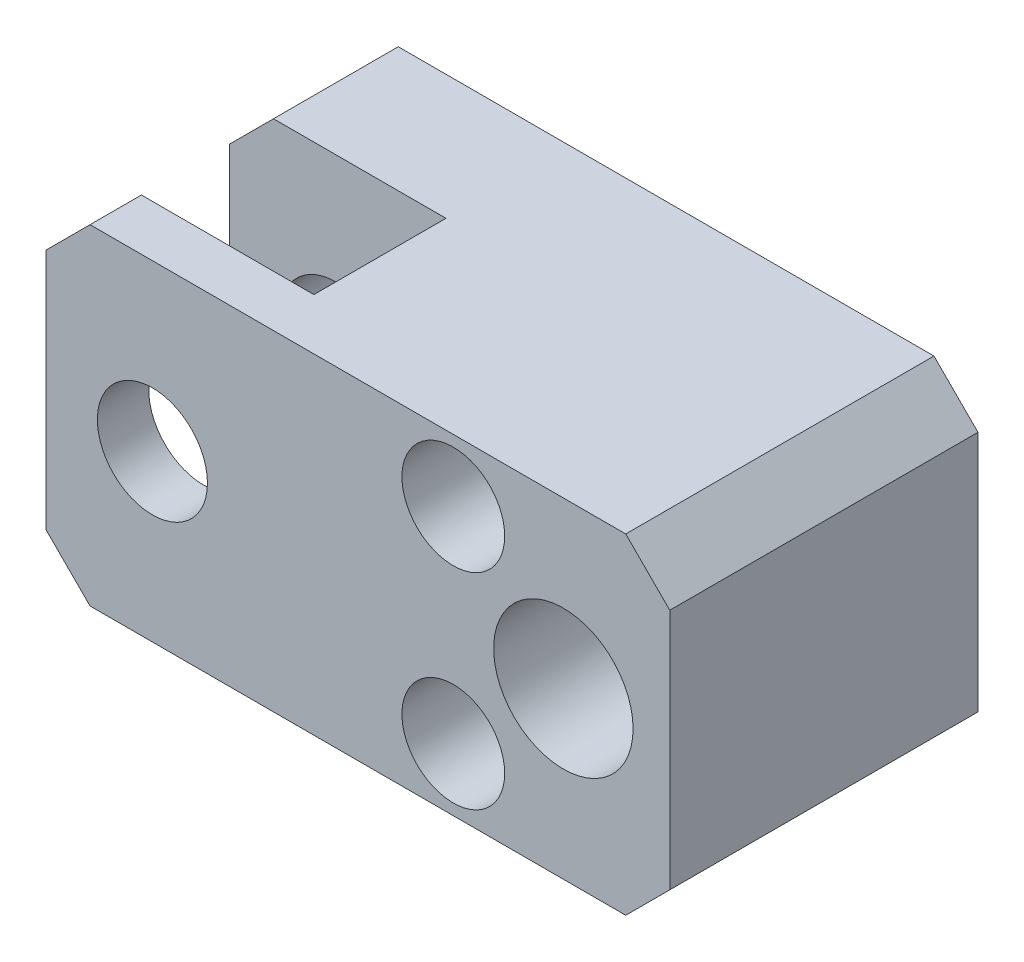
ISO-10303-21;
HEADER;
FILE_DESCRIPTION(('STEP AP214'),'2;1');
FILE_NAME('part.step','',(''),(''),'','','');
FILE_SCHEMA(('AUTOMOTIVE_DESIGN { 1 0 10303 214 1 1 1 1 }'));
ENDSEC;
DATA;
#1=APPLICATION_CONTEXT('core data for automotive mechanical design processes');
#2=APPLICATION_PROTOCOL_DEFINITION('international standard','automotive_design',2000,#1);
#3=PRODUCT_CONTEXT('',#1,'mechanical');
#4=PRODUCT('Part','Part','',(#3));
#5=PRODUCT_RELATED_PRODUCT_CATEGORY('part','',(#4));
#6=PRODUCT_DEFINITION_FORMATION('','',#4);
#7=PRODUCT_DEFINITION_CONTEXT('part definition',#1,'design');
#8=PRODUCT_DEFINITION('design','',#6,#7);
#9=PRODUCT_DEFINITION_SHAPE('','',#8);
#10=(LENGTH_UNIT() NAMED_UNIT(*) SI_UNIT(.MILLI.,.METRE.));
#11=(NAMED_UNIT(*) PLANE_ANGLE_UNIT() SI_UNIT($,.RADIAN.));
#12=(NAMED_UNIT(*) SI_UNIT($,.STERADIAN.) SOLID_ANGLE_UNIT());
#13=UNCERTAINTY_MEASURE_WITH_UNIT(LENGTH_MEASURE(1.E-05),#10,'distance_accuracy_value','');
#14=(GEOMETRIC_REPRESENTATION_CONTEXT(3) GLOBAL_UNCERTAINTY_ASSIGNED_CONTEXT((#13)) GLOBAL_UNIT_ASSIGNED_CONTEXT((#10,
#11,#12)) REPRESENTATION_CONTEXT('',''));
#15=CARTESIAN_POINT('',(0.,0.,0.));
#16=DIRECTION('',(0.,0.,1.));
#17=DIRECTION('',(1.,0.,0.));
#18=AXIS2_PLACEMENT_3D('',#15,#16,#17);
#19=CARTESIAN_POINT('',(-41.,14.,17.));
#20=DIRECTION('',(0.,0.,1.));
#21=DIRECTION('',(1.,0.,0.));
#22=AXIS2_PLACEMENT_3D('',#19,#20,#21);
#23=CYLINDRICAL_SURFACE('',#22,4.5);
#24=CARTESIAN_POINT('',(-41.,14.,0.));
#25=DIRECTION('',(0.,0.,1.));
#26=DIRECTION('',(1.,0.,0.));
#27=AXIS2_PLACEMENT_3D('',#24,#25,#26);
#28=CIRCLE('',#27,4.5);
#29=CARTESIAN_POINT('',(-36.5,14.,0.));
#30=VERTEX_POINT('',#29);
#31=EDGE_CURVE('E350',#30,#30,#28,.T.);
#32=ORIENTED_EDGE('',*,*,#31,.F.);
#33=EDGE_LOOP('',(#32));
#34=FACE_BOUND('',#33,.T.);
#35=CARTESIAN_POINT('',(-41.,14.,9.5));
#36=DIRECTION('',(0.,0.,1.));
#37=DIRECTION('',(1.,0.,0.));
#38=AXIS2_PLACEMENT_3D('',#35,#36,#37);
#39=CIRCLE('',#38,4.5);
#40=CARTESIAN_POINT('',(-36.5,14.,9.5));
#41=VERTEX_POINT('',#40);
#42=EDGE_CURVE('E186',#41,#41,#39,.F.);
#43=ORIENTED_EDGE('',*,*,#42,.F.);
#44=EDGE_LOOP('',(#43));
#45=FACE_BOUND('',#44,.T.);
#46=ADVANCED_FACE('F14',(#34,#45),#23,.F.);
#47=CARTESIAN_POINT('',(-26.,36.5,35.));
#48=DIRECTION('',(1.,0.,0.));
#49=DIRECTION('',(0.,1.,0.));
#50=AXIS2_PLACEMENT_3D('',#47,#48,#49);
#51=PLANE('',#50);
#52=DIRECTION('',(0.,0.,1.));
#53=VECTOR('',#52,1.);
#54=CARTESIAN_POINT('',(-26.,-8.5,35.));
#55=LINE('',#54,#53);
#56=CARTESIAN_POINT('',(-26.,-8.5,17.));
#57=VERTEX_POINT('',#56);
#58=CARTESIAN_POINT('',(-26.,-8.5,35.));
#59=VERTEX_POINT('',#58);
#60=EDGE_CURVE('E127',#57,#59,#55,.T.);
#61=ORIENTED_EDGE('',*,*,#60,.T.);
#62=DIRECTION('',(0.,-1.,0.));
#63=VECTOR('',#62,1.);
#64=CARTESIAN_POINT('',(-26.,36.5,35.));
#65=LINE('',#64,#63);
#66=CARTESIAN_POINT('',(-26.,36.5,35.));
#67=VERTEX_POINT('',#66);
#68=EDGE_CURVE('E136',#67,#59,#65,.T.);
#69=ORIENTED_EDGE('',*,*,#68,.F.);
#70=DIRECTION('',(0.,0.,1.));
#71=VECTOR('',#70,1.);
#72=CARTESIAN_POINT('',(-26.,36.5,35.));
#73=LINE('',#72,#71);
#74=CARTESIAN_POINT('',(-26.,36.5,17.));
#75=VERTEX_POINT('',#74);
#76=EDGE_CURVE('E135',#75,#67,#73,.T.);
#77=ORIENTED_EDGE('',*,*,#76,.F.);
#78=DIRECTION('',(0.,-1.,0.));
#79=VECTOR('',#78,1.);
#80=CARTESIAN_POINT('',(-26.,36.5,17.));
#81=LINE('',#80,#79);
#82=EDGE_CURVE('E119',#75,#57,#81,.T.);
#83=ORIENTED_EDGE('',*,*,#82,.T.);
#84=EDGE_LOOP('',(#61,#69,#77,#83));
#85=FACE_BOUND('',#84,.T.);
#86=ADVANCED_FACE('F132',(#85),#51,.F.);
#87=CARTESIAN_POINT('',(-55.5,36.5,17.));
#88=DIRECTION('',(0.,0.,-1.));
#89=DIRECTION('',(0.,1.,0.));
#90=AXIS2_PLACEMENT_3D('',#87,#88,#89);
#91=PLANE('',#90);
#92=CARTESIAN_POINT('',(-41.,14.,17.));
#93=DIRECTION('',(0.,0.,-1.));
#94=DIRECTION('',(0.,1.,0.));
#95=AXIS2_PLACEMENT_3D('',#92,#93,#94);
#96=CIRCLE('',#95,7.5);
#97=CARTESIAN_POINT('',(-41.,21.5,17.));
#98=VERTEX_POINT('',#97);
#99=EDGE_CURVE('E193',#98,#98,#96,.T.);
#100=ORIENTED_EDGE('',*,*,#99,.T.);
#101=EDGE_LOOP('',(#100));
#102=FACE_BOUND('',#101,.T.);
#103=DIRECTION('',(0.,-1.,0.));
#104=VECTOR('',#103,1.);
#105=CARTESIAN_POINT('',(-55.5,36.5,17.));
#106=LINE('',#105,#104);
#107=CARTESIAN_POINT('',(-55.5,30.5,17.));
#108=VERTEX_POINT('',#107);
#109=CARTESIAN_POINT('',(-55.5,-2.5,17.));
#110=VERTEX_POINT('',#109);
#111=EDGE_CURVE('E137',#108,#110,#106,.T.);
#112=ORIENTED_EDGE('',*,*,#111,.T.);
#113=DIRECTION('',(0.707106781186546,-0.707106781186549,0.));
#114=VECTOR('',#113,1.);
#115=CARTESIAN_POINT('',(-49.5,-8.5,17.));
#116=LINE('',#115,#114);
#117=CARTESIAN_POINT('',(-49.5,-8.5,17.));
#118=VERTEX_POINT('',#117);
#119=EDGE_CURVE('E122',#110,#118,#116,.T.);
#120=ORIENTED_EDGE('',*,*,#119,.T.);
#121=DIRECTION('',(1.,0.,0.));
#122=VECTOR('',#121,1.);
#123=CARTESIAN_POINT('',(-55.5,-8.5,17.));
#124=LINE('',#123,#122);
#125=EDGE_CURVE('E114',#118,#57,#124,.T.);
#126=ORIENTED_EDGE('',*,*,#125,.T.);
#127=ORIENTED_EDGE('',*,*,#82,.F.);
#128=DIRECTION('',(1.,0.,0.));
#129=VECTOR('',#128,1.);
#130=CARTESIAN_POINT('',(-55.5,36.5,17.));
#131=LINE('',#130,#129);
#132=CARTESIAN_POINT('',(-49.5,36.5,17.));
#133=VERTEX_POINT('',#132);
#134=EDGE_CURVE('E145',#133,#75,#131,.T.);
#135=ORIENTED_EDGE('',*,*,#134,.F.);
#136=DIRECTION('',(-0.707106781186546,-0.707106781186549,0.));
#137=VECTOR('',#136,1.);
#138=CARTESIAN_POINT('',(-49.5,36.5,17.));
#139=LINE('',#138,#137);
#140=EDGE_CURVE('E233',#133,#108,#139,.T.);
#141=ORIENTED_EDGE('',*,*,#140,.T.);
#142=EDGE_LOOP('',(#112,#120,#126,#127,#135,#141));
#143=FACE_BOUND('',#142,.T.);
#144=ADVANCED_FACE('F117',(#102,#143),#91,.F.);
#145=CARTESIAN_POINT('',(-55.5,36.5,0.));
#146=DIRECTION('',(-1.,0.,0.));
#147=DIRECTION('',(0.,-1.,0.));
#148=AXIS2_PLACEMENT_3D('',#145,#146,#147);
#149=PLANE('',#148);
#150=DIRECTION('',(0.,-1.,0.));
#151=VECTOR('',#150,1.);
#152=CARTESIAN_POINT('',(-55.5,36.5,35.));
#153=LINE('',#152,#151);
#154=CARTESIAN_POINT('',(-55.5,30.5,35.));
#155=VERTEX_POINT('',#154);
#156=CARTESIAN_POINT('',(-55.5,-2.5,35.));
#157=VERTEX_POINT('',#156);
#158=EDGE_CURVE('E151',#155,#157,#153,.T.);
#159=ORIENTED_EDGE('',*,*,#158,.T.);
#160=DIRECTION('',(0.,0.,1.));
#161=VECTOR('',#160,1.);
#162=CARTESIAN_POINT('',(-55.5,-2.5,42.));
#163=LINE('',#162,#161);
#164=CARTESIAN_POINT('',(-55.5,-2.5,42.));
#165=VERTEX_POINT('',#164);
#166=EDGE_CURVE('E9',#157,#165,#163,.T.);
#167=ORIENTED_EDGE('',*,*,#166,.T.);
#168=DIRECTION('',(0.,-1.,0.));
#169=VECTOR('',#168,1.);
#170=CARTESIAN_POINT('',(-55.5,-8.5,42.));
#171=LINE('',#170,#169);
#172=CARTESIAN_POINT('',(-55.5,30.5,42.));
#173=VERTEX_POINT('',#172);
#174=EDGE_CURVE('E164',#173,#165,#171,.T.);
#175=ORIENTED_EDGE('',*,*,#174,.F.);
#176=DIRECTION('',(0.,0.,-1.));
#177=VECTOR('',#176,1.);
#178=CARTESIAN_POINT('',(-55.5,30.5,35.));
#179=LINE('',#178,#177);
#180=EDGE_CURVE('E22',#173,#155,#179,.T.);
#181=ORIENTED_EDGE('',*,*,#180,.T.);
#182=EDGE_LOOP('',(#159,#167,#175,#181));
#183=FACE_BOUND('',#182,.T.);
#184=ADVANCED_FACE('F251',(#183),#149,.T.);
#185=CARTESIAN_POINT('',(29.5,-8.5,0.));
#186=DIRECTION('',(0.,0.,1.));
#187=DIRECTION('',(1.,0.,0.));
#188=AXIS2_PLACEMENT_3D('',#185,#186,#187);
#189=PLANE('',#188);
#190=CARTESIAN_POINT('',(0.,0.,0.));
#191=DIRECTION('',(0.,0.,1.));
#192=DIRECTION('',(1.,0.,0.));
#193=AXIS2_PLACEMENT_3D('',#190,#191,#192);
#194=CIRCLE('',#193,4.5);
#195=CARTESIAN_POINT('',(4.5,0.,0.));
#196=VERTEX_POINT('',#195);
#197=EDGE_CURVE('E344',#196,#196,#194,.T.);
#198=ORIENTED_EDGE('',*,*,#197,.T.);
#199=EDGE_LOOP('',(#198));
#200=FACE_BOUND('',#199,.T.);
#201=CARTESIAN_POINT('',(0.,28.,0.));
#202=DIRECTION('',(0.,0.,1.));
#203=DIRECTION('',(1.,0.,0.));
#204=AXIS2_PLACEMENT_3D('',#201,#202,#203);
#205=CIRCLE('',#204,4.5);
#206=CARTESIAN_POINT('',(4.5,28.,0.));
#207=VERTEX_POINT('',#206);
#208=EDGE_CURVE('E348',#207,#207,#205,.T.);
#209=ORIENTED_EDGE('',*,*,#208,.T.);
#210=EDGE_LOOP('',(#209));
#211=FACE_BOUND('',#210,.T.);
#212=ORIENTED_EDGE('',*,*,#31,.T.);
#213=EDGE_LOOP('',(#212));
#214=FACE_BOUND('',#213,.T.);
#215=DIRECTION('',(0.,1.,0.));
#216=VECTOR('',#215,1.);
#217=CARTESIAN_POINT('',(29.5,-8.5,0.));
#218=LINE('',#217,#216);
#219=CARTESIAN_POINT('',(29.5,-2.5,0.));
#220=VERTEX_POINT('',#219);
#221=CARTESIAN_POINT('',(29.5,30.5,0.));
#222=VERTEX_POINT('',#221);
#223=EDGE_CURVE('E167',#220,#222,#218,.T.);
#224=ORIENTED_EDGE('',*,*,#223,.F.);
#225=DIRECTION('',(0.707106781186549,0.707106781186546,0.));
#226=VECTOR('',#225,1.);
#227=CARTESIAN_POINT('',(29.5,-2.5,0.));
#228=LINE('',#227,#226);
#229=CARTESIAN_POINT('',(23.5,-8.5,0.));
#230=VERTEX_POINT('',#229);
#231=EDGE_CURVE('E205',#220,#230,#228,.F.);
#232=ORIENTED_EDGE('',*,*,#231,.T.);
#233=DIRECTION('',(-1.,0.,0.));
#234=VECTOR('',#233,1.);
#235=CARTESIAN_POINT('',(29.5,-8.5,0.));
#236=LINE('',#235,#234);
#237=CARTESIAN_POINT('',(-49.5,-8.5,0.));
#238=VERTEX_POINT('',#237);
#239=EDGE_CURVE('E173',#230,#238,#236,.T.);
#240=ORIENTED_EDGE('',*,*,#239,.T.);
#241=DIRECTION('',(-0.707106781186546,0.707106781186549,0.));
#242=VECTOR('',#241,1.);
#243=CARTESIAN_POINT('',(-49.5,-8.5,0.));
#244=LINE('',#243,#242);
#245=CARTESIAN_POINT('',(-55.5,-2.5,0.));
#246=VERTEX_POINT('',#245);
#247=EDGE_CURVE('E201',#238,#246,#244,.T.);
#248=ORIENTED_EDGE('',*,*,#247,.T.);
#249=DIRECTION('',(0.,1.,0.));
#250=VECTOR('',#249,1.);
#251=CARTESIAN_POINT('',(-55.5,-8.5,0.));
#252=LINE('',#251,#250);
#253=CARTESIAN_POINT('',(-55.5,30.5,0.));
#254=VERTEX_POINT('',#253);
#255=EDGE_CURVE('E161',#246,#254,#252,.T.);
#256=ORIENTED_EDGE('',*,*,#255,.T.);
#257=DIRECTION('',(0.707106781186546,0.707106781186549,0.));
#258=VECTOR('',#257,1.);
#259=CARTESIAN_POINT('',(-49.5,36.5,0.));
#260=LINE('',#259,#258);
#261=CARTESIAN_POINT('',(-49.5,36.5,0.));
#262=VERTEX_POINT('',#261);
#263=EDGE_CURVE('E199',#254,#262,#260,.T.);
#264=ORIENTED_EDGE('',*,*,#263,.T.);
#265=DIRECTION('',(-1.,0.,0.));
#266=VECTOR('',#265,1.);
#267=CARTESIAN_POINT('',(29.5,36.5,0.));
#268=LINE('',#267,#266);
#269=CARTESIAN_POINT('',(23.5,36.5,0.));
#270=VERTEX_POINT('',#269);
#271=EDGE_CURVE('E182',#270,#262,#268,.T.);
#272=ORIENTED_EDGE('',*,*,#271,.F.);
#273=DIRECTION('',(-0.707106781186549,0.707106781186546,0.));
#274=VECTOR('',#273,1.);
#275=CARTESIAN_POINT('',(29.5,30.5,0.));
#276=LINE('',#275,#274);
#277=EDGE_CURVE('E203',#270,#222,#276,.F.);
#278=ORIENTED_EDGE('',*,*,#277,.T.);
#279=EDGE_LOOP('',(#224,#232,#240,#248,#256,#264,#272,#278));
#280=FACE_BOUND('',#279,.T.);
#281=ADVANCED_FACE('F16',(#200,#211,#214,#280),#189,.F.);
#282=CARTESIAN_POINT('',(29.5,36.5,42.));
#283=DIRECTION('',(0.,-1.,0.));
#284=DIRECTION('',(0.,0.,-1.));
#285=AXIS2_PLACEMENT_3D('',#282,#283,#284);
#286=PLANE('',#285);
#287=DIRECTION('',(-1.,0.,0.));
#288=VECTOR('',#287,1.);
#289=CARTESIAN_POINT('',(29.5,36.5,42.));
#290=LINE('',#289,#288);
#291=CARTESIAN_POINT('',(23.5,36.5,42.));
#292=VERTEX_POINT('',#291);
#293=CARTESIAN_POINT('',(-49.5,36.5,42.));
#294=VERTEX_POINT('',#293);
#295=EDGE_CURVE('E179',#292,#294,#290,.T.);
#296=ORIENTED_EDGE('',*,*,#295,.F.);
#297=DIRECTION('',(0.,0.,-1.));
#298=VECTOR('',#297,1.);
#299=CARTESIAN_POINT('',(23.5,36.5,42.));
#300=LINE('',#299,#298);
#301=EDGE_CURVE('E227',#292,#270,#300,.T.);
#302=ORIENTED_EDGE('',*,*,#301,.T.);
#303=ORIENTED_EDGE('',*,*,#271,.T.);
#304=DIRECTION('',(0.,0.,1.));
#305=VECTOR('',#304,1.);
#306=CARTESIAN_POINT('',(-49.5,36.5,17.));
#307=LINE('',#306,#305);
#308=EDGE_CURVE('E221',#262,#133,#307,.T.);
#309=ORIENTED_EDGE('',*,*,#308,.T.);
#310=ORIENTED_EDGE('',*,*,#134,.T.);
#311=ORIENTED_EDGE('',*,*,#76,.T.);
#312=DIRECTION('',(-1.,0.,0.));
#313=VECTOR('',#312,1.);
#314=CARTESIAN_POINT('',(-55.5,36.5,35.));
#315=LINE('',#314,#313);
#316=CARTESIAN_POINT('',(-49.5,36.5,35.));
#317=VERTEX_POINT('',#316);
#318=EDGE_CURVE('E142',#67,#317,#315,.T.);
#319=ORIENTED_EDGE('',*,*,#318,.T.);
#320=DIRECTION('',(0.,0.,1.));
#321=VECTOR('',#320,1.);
#322=CARTESIAN_POINT('',(-49.5,36.5,42.));
#323=LINE('',#322,#321);
#324=EDGE_CURVE('E224',#317,#294,#323,.T.);
#325=ORIENTED_EDGE('',*,*,#324,.T.);
#326=EDGE_LOOP('',(#296,#302,#303,#309,#310,#311,#319,#325));
#327=FACE_BOUND('',#326,.T.);
#328=ADVANCED_FACE('F245',(#327),#286,.F.);
#329=CARTESIAN_POINT('',(29.5,-8.5,42.));
#330=DIRECTION('',(0.,0.,-1.));
#331=DIRECTION('',(-1.,0.,0.));
#332=AXIS2_PLACEMENT_3D('',#329,#330,#331);
#333=PLANE('',#332);
#334=CARTESIAN_POINT('',(0.,0.,42.));
#335=DIRECTION('',(0.,0.,1.));
#336=DIRECTION('',(1.,0.,0.));
#337=AXIS2_PLACEMENT_3D('',#334,#335,#336);
#338=CIRCLE('',#337,7.);
#339=CARTESIAN_POINT('',(7.,0.,42.));
#340=VERTEX_POINT('',#339);
#341=EDGE_CURVE('E370',#340,#340,#338,.T.);
#342=ORIENTED_EDGE('',*,*,#341,.F.);
#343=EDGE_LOOP('',(#342));
#344=FACE_BOUND('',#343,.T.);
#345=CARTESIAN_POINT('',(0.,28.,42.));
#346=DIRECTION('',(0.,0.,1.));
#347=DIRECTION('',(1.,0.,0.));
#348=AXIS2_PLACEMENT_3D('',#345,#346,#347);
#349=CIRCLE('',#348,7.);
#350=CARTESIAN_POINT('',(7.,28.,42.));
#351=VERTEX_POINT('',#350);
#352=EDGE_CURVE('E360',#351,#351,#349,.T.);
#353=ORIENTED_EDGE('',*,*,#352,.F.);
#354=EDGE_LOOP('',(#353));
#355=FACE_BOUND('',#354,.T.);
#356=CARTESIAN_POINT('',(-41.,14.,42.));
#357=DIRECTION('',(0.,0.,1.));
#358=DIRECTION('',(1.,0.,0.));
#359=AXIS2_PLACEMENT_3D('',#356,#357,#358);
#360=CIRCLE('',#359,7.5);
#361=CARTESIAN_POINT('',(-33.5,14.,42.));
#362=VERTEX_POINT('',#361);
#363=EDGE_CURVE('E357',#362,#362,#360,.T.);
#364=ORIENTED_EDGE('',*,*,#363,.F.);
#365=EDGE_LOOP('',(#364));
#366=FACE_BOUND('',#365,.T.);
#367=CARTESIAN_POINT('',(15.,14.,42.));
#368=DIRECTION('',(0.,0.,1.));
#369=DIRECTION('',(1.,0.,0.));
#370=AXIS2_PLACEMENT_3D('',#367,#368,#369);
#371=CIRCLE('',#370,9.5);
#372=CARTESIAN_POINT('',(24.5,14.,42.));
#373=VERTEX_POINT('',#372);
#374=EDGE_CURVE('E152',#373,#373,#371,.T.);
#375=ORIENTED_EDGE('',*,*,#374,.F.);
#376=EDGE_LOOP('',(#375));
#377=FACE_BOUND('',#376,.T.);
#378=DIRECTION('',(-1.,0.,0.));
#379=VECTOR('',#378,1.);
#380=CARTESIAN_POINT('',(29.5,-8.5,42.));
#381=LINE('',#380,#379);
#382=CARTESIAN_POINT('',(23.5,-8.5,42.));
#383=VERTEX_POINT('',#382);
#384=CARTESIAN_POINT('',(-49.5,-8.5,42.));
#385=VERTEX_POINT('',#384);
#386=EDGE_CURVE('E176',#383,#385,#381,.T.);
#387=ORIENTED_EDGE('',*,*,#386,.F.);
#388=DIRECTION('',(-0.707106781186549,-0.707106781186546,0.));
#389=VECTOR('',#388,1.);
#390=CARTESIAN_POINT('',(29.5,-2.5,42.));
#391=LINE('',#390,#389);
#392=CARTESIAN_POINT('',(29.5,-2.5,42.));
#393=VERTEX_POINT('',#392);
#394=EDGE_CURVE('E219',#383,#393,#391,.F.);
#395=ORIENTED_EDGE('',*,*,#394,.T.);
#396=DIRECTION('',(0.,-1.,0.));
#397=VECTOR('',#396,1.);
#398=CARTESIAN_POINT('',(29.5,-8.5,42.));
#399=LINE('',#398,#397);
#400=CARTESIAN_POINT('',(29.5,30.5,42.));
#401=VERTEX_POINT('',#400);
#402=EDGE_CURVE('E170',#401,#393,#399,.T.);
#403=ORIENTED_EDGE('',*,*,#402,.F.);
#404=DIRECTION('',(0.707106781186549,-0.707106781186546,0.));
#405=VECTOR('',#404,1.);
#406=CARTESIAN_POINT('',(29.5,30.5,42.));
#407=LINE('',#406,#405);
#408=EDGE_CURVE('E217',#401,#292,#407,.F.);
#409=ORIENTED_EDGE('',*,*,#408,.T.);
#410=ORIENTED_EDGE('',*,*,#295,.T.);
#411=DIRECTION('',(-0.707106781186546,-0.707106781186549,0.));
#412=VECTOR('',#411,1.);
#413=CARTESIAN_POINT('',(-49.5,36.5,42.));
#414=LINE('',#413,#412);
#415=EDGE_CURVE('E213',#294,#173,#414,.T.);
#416=ORIENTED_EDGE('',*,*,#415,.T.);
#417=ORIENTED_EDGE('',*,*,#174,.T.);
#418=DIRECTION('',(0.707106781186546,-0.707106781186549,0.));
#419=VECTOR('',#418,1.);
#420=CARTESIAN_POINT('',(-49.5,-8.5,42.));
#421=LINE('',#420,#419);
#422=EDGE_CURVE('E215',#165,#385,#421,.T.);
#423=ORIENTED_EDGE('',*,*,#422,.T.);
#424=EDGE_LOOP('',(#387,#395,#403,#409,#410,#416,#417,#423));
#425=FACE_BOUND('',#424,.T.);
#426=ADVANCED_FACE('F249',(#344,#355,#366,#377,#425),#333,.F.);
#427=CARTESIAN_POINT('',(29.5,-8.5,42.));
#428=DIRECTION('',(0.,1.,0.));
#429=DIRECTION('',(0.,0.,1.));
#430=AXIS2_PLACEMENT_3D('',#427,#428,#429);
#431=PLANE('',#430);
#432=ORIENTED_EDGE('',*,*,#239,.F.);
#433=DIRECTION('',(0.,0.,1.));
#434=VECTOR('',#433,1.);
#435=CARTESIAN_POINT('',(23.5,-8.5,42.));
#436=LINE('',#435,#434);
#437=EDGE_CURVE('E211',#230,#383,#436,.T.);
#438=ORIENTED_EDGE('',*,*,#437,.T.);
#439=ORIENTED_EDGE('',*,*,#386,.T.);
#440=DIRECTION('',(0.,0.,-1.));
#441=VECTOR('',#440,1.);
#442=CARTESIAN_POINT('',(-49.5,-8.5,35.));
#443=LINE('',#442,#441);
#444=CARTESIAN_POINT('',(-49.5,-8.5,35.));
#445=VERTEX_POINT('',#444);
#446=EDGE_CURVE('E207',#385,#445,#443,.T.);
#447=ORIENTED_EDGE('',*,*,#446,.T.);
#448=DIRECTION('',(-1.,0.,0.));
#449=VECTOR('',#448,1.);
#450=CARTESIAN_POINT('',(-55.5,-8.5,35.));
#451=LINE('',#450,#449);
#452=EDGE_CURVE('E128',#59,#445,#451,.T.);
#453=ORIENTED_EDGE('',*,*,#452,.F.);
#454=ORIENTED_EDGE('',*,*,#60,.F.);
#455=ORIENTED_EDGE('',*,*,#125,.F.);
#456=DIRECTION('',(0.,0.,-1.));
#457=VECTOR('',#456,1.);
#458=CARTESIAN_POINT('',(-49.5,-8.5,0.));
#459=LINE('',#458,#457);
#460=EDGE_CURVE('E209',#118,#238,#459,.T.);
#461=ORIENTED_EDGE('',*,*,#460,.T.);
#462=EDGE_LOOP('',(#432,#438,#439,#447,#453,#454,#455,#461));
#463=FACE_BOUND('',#462,.T.);
#464=ADVANCED_FACE('F140',(#463),#431,.F.);
#465=CARTESIAN_POINT('',(29.5,36.5,0.));
#466=DIRECTION('',(-1.,0.,0.));
#467=DIRECTION('',(0.,-1.,0.));
#468=AXIS2_PLACEMENT_3D('',#465,#466,#467);
#469=PLANE('',#468);
#470=ORIENTED_EDGE('',*,*,#402,.T.);
#471=DIRECTION('',(0.,0.,-1.));
#472=VECTOR('',#471,1.);
#473=CARTESIAN_POINT('',(29.5,-2.5,0.));
#474=LINE('',#473,#472);
#475=EDGE_CURVE('E196',#393,#220,#474,.T.);
#476=ORIENTED_EDGE('',*,*,#475,.T.);
#477=ORIENTED_EDGE('',*,*,#223,.T.);
#478=DIRECTION('',(0.,0.,1.));
#479=VECTOR('',#478,1.);
#480=CARTESIAN_POINT('',(29.5,30.5,0.));
#481=LINE('',#480,#479);
#482=EDGE_CURVE('E185',#222,#401,#481,.T.);
#483=ORIENTED_EDGE('',*,*,#482,.T.);
#484=EDGE_LOOP('',(#470,#476,#477,#483));
#485=FACE_BOUND('',#484,.T.);
#486=ADVANCED_FACE('F263',(#485),#469,.F.);
#487=ORIENTED_EDGE('',*,*,#255,.F.);
#488=DIRECTION('',(0.,0.,1.));
#489=VECTOR('',#488,1.);
#490=CARTESIAN_POINT('',(-55.5,-2.5,17.));
#491=LINE('',#490,#489);
#492=EDGE_CURVE('E231',#246,#110,#491,.T.);
#493=ORIENTED_EDGE('',*,*,#492,.T.);
#494=ORIENTED_EDGE('',*,*,#111,.F.);
#495=DIRECTION('',(0.,0.,-1.));
#496=VECTOR('',#495,1.);
#497=CARTESIAN_POINT('',(-55.5,30.5,0.));
#498=LINE('',#497,#496);
#499=EDGE_CURVE('E229',#108,#254,#498,.T.);
#500=ORIENTED_EDGE('',*,*,#499,.T.);
#501=EDGE_LOOP('',(#487,#493,#494,#500));
#502=FACE_BOUND('',#501,.T.);
#503=ADVANCED_FACE('F280',(#502),#149,.T.);
#504=CARTESIAN_POINT('',(15.,14.,7.));
#505=DIRECTION('',(0.,0.,1.));
#506=DIRECTION('',(1.,0.,0.));
#507=AXIS2_PLACEMENT_3D('',#504,#505,#506);
#508=CYLINDRICAL_SURFACE('',#507,9.5);
#509=CARTESIAN_POINT('',(15.,14.,7.));
#510=DIRECTION('',(0.,0.,1.));
#511=DIRECTION('',(1.,0.,0.));
#512=AXIS2_PLACEMENT_3D('',#509,#510,#511);
#513=CIRCLE('',#512,9.5);
#514=CARTESIAN_POINT('',(24.5,14.,7.));
#515=VERTEX_POINT('',#514);
#516=EDGE_CURVE('E158',#515,#515,#513,.T.);
#517=ORIENTED_EDGE('',*,*,#516,.F.);
#518=EDGE_LOOP('',(#517));
#519=FACE_BOUND('',#518,.T.);
#520=ORIENTED_EDGE('',*,*,#374,.T.);
#521=EDGE_LOOP('',(#520));
#522=FACE_BOUND('',#521,.T.);
#523=ADVANCED_FACE('F318',(#519,#522),#508,.F.);
#524=CARTESIAN_POINT('',(15.,14.,7.));
#525=DIRECTION('',(0.,0.,1.));
#526=DIRECTION('',(1.,0.,0.));
#527=AXIS2_PLACEMENT_3D('',#524,#525,#526);
#528=PLANE('',#527);
#529=ORIENTED_EDGE('',*,*,#516,.T.);
#530=EDGE_LOOP('',(#529));
#531=FACE_BOUND('',#530,.T.);
#532=ADVANCED_FACE('F314',(#531),#528,.T.);
#533=CARTESIAN_POINT('',(-55.5,36.5,35.));
#534=DIRECTION('',(0.,0.,1.));
#535=DIRECTION('',(0.,-1.,0.));
#536=AXIS2_PLACEMENT_3D('',#533,#534,#535);
#537=PLANE('',#536);
#538=CARTESIAN_POINT('',(-41.,14.,35.));
#539=DIRECTION('',(0.,0.,1.));
#540=DIRECTION('',(0.,-1.,0.));
#541=AXIS2_PLACEMENT_3D('',#538,#539,#540);
#542=CIRCLE('',#541,7.5);
#543=CARTESIAN_POINT('',(-41.,6.5,35.));
#544=VERTEX_POINT('',#543);
#545=EDGE_CURVE('E189',#544,#544,#542,.T.);
#546=ORIENTED_EDGE('',*,*,#545,.T.);
#547=EDGE_LOOP('',(#546));
#548=FACE_BOUND('',#547,.T.);
#549=ORIENTED_EDGE('',*,*,#452,.T.);
#550=DIRECTION('',(-0.707106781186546,0.707106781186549,0.));
#551=VECTOR('',#550,1.);
#552=CARTESIAN_POINT('',(-49.5,-8.5,35.));
#553=LINE('',#552,#551);
#554=EDGE_CURVE('E29',#445,#157,#553,.T.);
#555=ORIENTED_EDGE('',*,*,#554,.T.);
#556=ORIENTED_EDGE('',*,*,#158,.F.);
#557=DIRECTION('',(0.707106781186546,0.707106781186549,0.));
#558=VECTOR('',#557,1.);
#559=CARTESIAN_POINT('',(-49.5,36.5,35.));
#560=LINE('',#559,#558);
#561=EDGE_CURVE('E236',#155,#317,#560,.T.);
#562=ORIENTED_EDGE('',*,*,#561,.T.);
#563=ORIENTED_EDGE('',*,*,#318,.F.);
#564=ORIENTED_EDGE('',*,*,#68,.T.);
#565=EDGE_LOOP('',(#549,#555,#556,#562,#563,#564));
#566=FACE_BOUND('',#565,.T.);
#567=ADVANCED_FACE('F240',(#548,#566),#537,.F.);
#568=CARTESIAN_POINT('',(-41.,14.,9.5));
#569=DIRECTION('',(0.,0.,1.));
#570=DIRECTION('',(1.,0.,0.));
#571=AXIS2_PLACEMENT_3D('',#568,#569,#570);
#572=PLANE('',#571);
#573=CARTESIAN_POINT('',(-41.,14.,9.5));
#574=DIRECTION('',(0.,0.,1.));
#575=DIRECTION('',(1.,0.,0.));
#576=AXIS2_PLACEMENT_3D('',#573,#574,#575);
#577=CIRCLE('',#576,7.5);
#578=CARTESIAN_POINT('',(-33.5,14.,9.5));
#579=VERTEX_POINT('',#578);
#580=EDGE_CURVE('E190',#579,#579,#577,.T.);
#581=ORIENTED_EDGE('',*,*,#580,.T.);
#582=EDGE_LOOP('',(#581));
#583=FACE_BOUND('',#582,.T.);
#584=ORIENTED_EDGE('',*,*,#42,.T.);
#585=EDGE_LOOP('',(#584));
#586=FACE_BOUND('',#585,.T.);
#587=ADVANCED_FACE('F313',(#583,#586),#572,.T.);
#588=CARTESIAN_POINT('',(-41.,14.,9.5));
#589=DIRECTION('',(0.,0.,1.));
#590=DIRECTION('',(1.,0.,0.));
#591=AXIS2_PLACEMENT_3D('',#588,#589,#590);
#592=CYLINDRICAL_SURFACE('',#591,7.5);
#593=ORIENTED_EDGE('',*,*,#580,.F.);
#594=EDGE_LOOP('',(#593));
#595=FACE_BOUND('',#594,.T.);
#596=ORIENTED_EDGE('',*,*,#99,.F.);
#597=EDGE_LOOP('',(#596));
#598=FACE_BOUND('',#597,.T.);
#599=ADVANCED_FACE('F305',(#595,#598),#592,.F.);
#600=ORIENTED_EDGE('',*,*,#363,.T.);
#601=EDGE_LOOP('',(#600));
#602=FACE_BOUND('',#601,.T.);
#603=ORIENTED_EDGE('',*,*,#545,.F.);
#604=EDGE_LOOP('',(#603));
#605=FACE_BOUND('',#604,.T.);
#606=ADVANCED_FACE('F403',(#602,#605),#592,.F.);
#607=CARTESIAN_POINT('',(0.,28.,42.));
#608=DIRECTION('',(0.,0.,1.));
#609=DIRECTION('',(1.,0.,0.));
#610=AXIS2_PLACEMENT_3D('',#607,#608,#609);
#611=CYLINDRICAL_SURFACE('',#610,7.);
#612=CARTESIAN_POINT('',(0.,28.,30.));
#613=DIRECTION('',(0.,0.,1.));
#614=DIRECTION('',(1.,0.,0.));
#615=AXIS2_PLACEMENT_3D('',#612,#613,#614);
#616=CIRCLE('',#615,7.);
#617=CARTESIAN_POINT('',(7.,28.,30.));
#618=VERTEX_POINT('',#617);
#619=EDGE_CURVE('E363',#618,#618,#616,.T.);
#620=ORIENTED_EDGE('',*,*,#619,.F.);
#621=EDGE_LOOP('',(#620));
#622=FACE_BOUND('',#621,.T.);
#623=ORIENTED_EDGE('',*,*,#352,.T.);
#624=EDGE_LOOP('',(#623));
#625=FACE_BOUND('',#624,.T.);
#626=ADVANCED_FACE('F406',(#622,#625),#611,.F.);
#627=CARTESIAN_POINT('',(0.,32.5,30.));
#628=DIRECTION('',(0.,0.,-1.));
#629=DIRECTION('',(-1.,0.,0.));
#630=AXIS2_PLACEMENT_3D('',#627,#628,#629);
#631=PLANE('',#630);
#632=CARTESIAN_POINT('',(0.,28.,30.));
#633=DIRECTION('',(0.,0.,1.));
#634=DIRECTION('',(1.,0.,0.));
#635=AXIS2_PLACEMENT_3D('',#632,#633,#634);
#636=CIRCLE('',#635,4.5);
#637=CARTESIAN_POINT('',(4.5,28.,30.));
#638=VERTEX_POINT('',#637);
#639=EDGE_CURVE('E366',#638,#638,#636,.T.);
#640=ORIENTED_EDGE('',*,*,#639,.F.);
#641=EDGE_LOOP('',(#640));
#642=FACE_BOUND('',#641,.T.);
#643=ORIENTED_EDGE('',*,*,#619,.T.);
#644=EDGE_LOOP('',(#643));
#645=FACE_BOUND('',#644,.T.);
#646=ADVANCED_FACE('F413',(#642,#645),#631,.F.);
#647=CARTESIAN_POINT('',(0.,28.,42.));
#648=DIRECTION('',(0.,0.,1.));
#649=DIRECTION('',(1.,0.,0.));
#650=AXIS2_PLACEMENT_3D('',#647,#648,#649);
#651=CYLINDRICAL_SURFACE('',#650,4.5);
#652=ORIENTED_EDGE('',*,*,#208,.F.);
#653=EDGE_LOOP('',(#652));
#654=FACE_BOUND('',#653,.T.);
#655=ORIENTED_EDGE('',*,*,#639,.T.);
#656=EDGE_LOOP('',(#655));
#657=FACE_BOUND('',#656,.T.);
#658=ADVANCED_FACE('F392',(#654,#657),#651,.F.);
#659=CARTESIAN_POINT('',(0.,0.,42.));
#660=DIRECTION('',(0.,0.,1.));
#661=DIRECTION('',(1.,0.,0.));
#662=AXIS2_PLACEMENT_3D('',#659,#660,#661);
#663=CYLINDRICAL_SURFACE('',#662,7.);
#664=CARTESIAN_POINT('',(0.,0.,30.));
#665=DIRECTION('',(0.,0.,1.));
#666=DIRECTION('',(1.,0.,0.));
#667=AXIS2_PLACEMENT_3D('',#664,#665,#666);
#668=CIRCLE('',#667,7.);
#669=CARTESIAN_POINT('',(7.,0.,30.));
#670=VERTEX_POINT('',#669);
#671=EDGE_CURVE('E373',#670,#670,#668,.T.);
#672=ORIENTED_EDGE('',*,*,#671,.F.);
#673=EDGE_LOOP('',(#672));
#674=FACE_BOUND('',#673,.T.);
#675=ORIENTED_EDGE('',*,*,#341,.T.);
#676=EDGE_LOOP('',(#675));
#677=FACE_BOUND('',#676,.T.);
#678=ADVANCED_FACE('F386',(#674,#677),#663,.F.);
#679=CARTESIAN_POINT('',(0.,4.5,30.));
#680=DIRECTION('',(0.,0.,-1.));
#681=DIRECTION('',(-1.,0.,0.));
#682=AXIS2_PLACEMENT_3D('',#679,#680,#681);
#683=PLANE('',#682);
#684=CARTESIAN_POINT('',(0.,0.,30.));
#685=DIRECTION('',(0.,0.,1.));
#686=DIRECTION('',(1.,0.,0.));
#687=AXIS2_PLACEMENT_3D('',#684,#685,#686);
#688=CIRCLE('',#687,4.5);
#689=CARTESIAN_POINT('',(4.5,0.,30.));
#690=VERTEX_POINT('',#689);
#691=EDGE_CURVE('E376',#690,#690,#688,.T.);
#692=ORIENTED_EDGE('',*,*,#691,.F.);
#693=EDGE_LOOP('',(#692));
#694=FACE_BOUND('',#693,.T.);
#695=ORIENTED_EDGE('',*,*,#671,.T.);
#696=EDGE_LOOP('',(#695));
#697=FACE_BOUND('',#696,.T.);
#698=ADVANCED_FACE('F383',(#694,#697),#683,.F.);
#699=CARTESIAN_POINT('',(0.,0.,42.));
#700=DIRECTION('',(0.,0.,1.));
#701=DIRECTION('',(1.,0.,0.));
#702=AXIS2_PLACEMENT_3D('',#699,#700,#701);
#703=CYLINDRICAL_SURFACE('',#702,4.5);
#704=ORIENTED_EDGE('',*,*,#197,.F.);
#705=EDGE_LOOP('',(#704));
#706=FACE_BOUND('',#705,.T.);
#707=ORIENTED_EDGE('',*,*,#691,.T.);
#708=EDGE_LOOP('',(#707));
#709=FACE_BOUND('',#708,.T.);
#710=ADVANCED_FACE('F381',(#706,#709),#703,.F.);
#711=CARTESIAN_POINT('',(29.5,-2.5,0.));
#712=DIRECTION('',(-0.707106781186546,0.707106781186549,0.));
#713=DIRECTION('',(-0.707106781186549,-0.707106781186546,0.));
#714=AXIS2_PLACEMENT_3D('',#711,#712,#713);
#715=PLANE('',#714);
#716=ORIENTED_EDGE('',*,*,#394,.F.);
#717=ORIENTED_EDGE('',*,*,#437,.F.);
#718=ORIENTED_EDGE('',*,*,#231,.F.);
#719=ORIENTED_EDGE('',*,*,#475,.F.);
#720=EDGE_LOOP('',(#716,#717,#718,#719));
#721=FACE_BOUND('',#720,.T.);
#722=ADVANCED_FACE('F259',(#721),#715,.F.);
#723=CARTESIAN_POINT('',(29.5,30.5,0.));
#724=DIRECTION('',(-0.707106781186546,-0.707106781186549,0.));
#725=DIRECTION('',(0.707106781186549,-0.707106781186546,0.));
#726=AXIS2_PLACEMENT_3D('',#723,#724,#725);
#727=PLANE('',#726);
#728=ORIENTED_EDGE('',*,*,#277,.F.);
#729=ORIENTED_EDGE('',*,*,#301,.F.);
#730=ORIENTED_EDGE('',*,*,#408,.F.);
#731=ORIENTED_EDGE('',*,*,#482,.F.);
#732=EDGE_LOOP('',(#728,#729,#730,#731));
#733=FACE_BOUND('',#732,.T.);
#734=ADVANCED_FACE('F268',(#733),#727,.F.);
#735=CARTESIAN_POINT('',(-49.5,-8.5,42.));
#736=DIRECTION('',(-0.707106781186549,-0.707106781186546,0.));
#737=DIRECTION('',(0.707106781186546,-0.707106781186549,0.));
#738=AXIS2_PLACEMENT_3D('',#735,#736,#737);
#739=PLANE('',#738);
#740=ORIENTED_EDGE('',*,*,#119,.F.);
#741=ORIENTED_EDGE('',*,*,#492,.F.);
#742=ORIENTED_EDGE('',*,*,#247,.F.);
#743=ORIENTED_EDGE('',*,*,#460,.F.);
#744=EDGE_LOOP('',(#740,#741,#742,#743));
#745=FACE_BOUND('',#744,.T.);
#746=ADVANCED_FACE('F283',(#745),#739,.T.);
#747=CARTESIAN_POINT('',(-49.5,-8.5,42.));
#748=DIRECTION('',(-0.707106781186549,-0.707106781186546,0.));
#749=DIRECTION('',(0.707106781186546,-0.707106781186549,0.));
#750=AXIS2_PLACEMENT_3D('',#747,#748,#749);
#751=PLANE('',#750);
#752=ORIENTED_EDGE('',*,*,#422,.F.);
#753=ORIENTED_EDGE('',*,*,#166,.F.);
#754=ORIENTED_EDGE('',*,*,#554,.F.);
#755=ORIENTED_EDGE('',*,*,#446,.F.);
#756=EDGE_LOOP('',(#752,#753,#754,#755));
#757=FACE_BOUND('',#756,.T.);
#758=ADVANCED_FACE('F254',(#757),#751,.T.);
#759=CARTESIAN_POINT('',(-49.5,36.5,42.));
#760=DIRECTION('',(-0.707106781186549,0.707106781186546,0.));
#761=DIRECTION('',(-0.707106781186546,-0.707106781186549,0.));
#762=AXIS2_PLACEMENT_3D('',#759,#760,#761);
#763=PLANE('',#762);
#764=ORIENTED_EDGE('',*,*,#561,.F.);
#765=ORIENTED_EDGE('',*,*,#180,.F.);
#766=ORIENTED_EDGE('',*,*,#415,.F.);
#767=ORIENTED_EDGE('',*,*,#324,.F.);
#768=EDGE_LOOP('',(#764,#765,#766,#767));
#769=FACE_BOUND('',#768,.T.);
#770=ADVANCED_FACE('F246',(#769),#763,.T.);
#771=CARTESIAN_POINT('',(-49.5,36.5,42.));
#772=DIRECTION('',(-0.707106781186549,0.707106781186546,0.));
#773=DIRECTION('',(-0.707106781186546,-0.707106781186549,0.));
#774=AXIS2_PLACEMENT_3D('',#771,#772,#773);
#775=PLANE('',#774);
#776=ORIENTED_EDGE('',*,*,#263,.F.);
#777=ORIENTED_EDGE('',*,*,#499,.F.);
#778=ORIENTED_EDGE('',*,*,#140,.F.);
#779=ORIENTED_EDGE('',*,*,#308,.F.);
#780=EDGE_LOOP('',(#776,#777,#778,#779));
#781=FACE_BOUND('',#780,.T.);
#782=ADVANCED_FACE('F277',(#781),#775,.T.);
#783=CLOSED_SHELL('',(#46,#86,#144,#184,#281,#328,#426,#464,#486,#503,#523,#532,#567,#587,#599,
#606,#626,#646,#658,#678,#698,#710,#722,#734,#746,#758,#770,#782));
#784=MANIFOLD_SOLID_BREP('B1',#783);
#785=ADVANCED_BREP_SHAPE_REPRESENTATION('',(#18,#784),#14);
#786=SHAPE_DEFINITION_REPRESENTATION(#9,#785);
ENDSEC;
END-ISO-10303-21;
